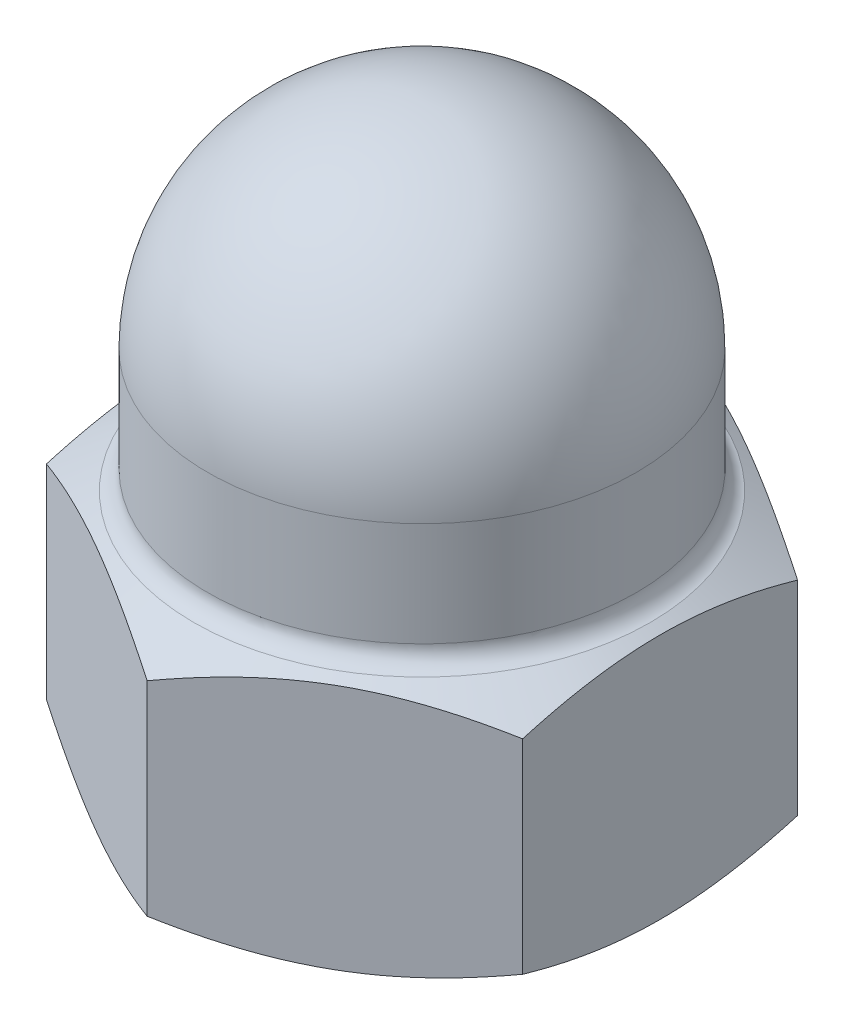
ISO-10303-21;
HEADER;
FILE_DESCRIPTION(('STEP AP214'),'2;1');
FILE_NAME('part.step','',(''),(''),'','','');
FILE_SCHEMA(('AUTOMOTIVE_DESIGN { 1 0 10303 214 1 1 1 1 }'));
ENDSEC;
DATA;
#1=APPLICATION_CONTEXT('core data for automotive mechanical design processes');
#2=APPLICATION_PROTOCOL_DEFINITION('international standard','automotive_design',2000,#1);
#3=PRODUCT_CONTEXT('',#1,'mechanical');
#4=PRODUCT('Part','Part','',(#3));
#5=PRODUCT_RELATED_PRODUCT_CATEGORY('part','',(#4));
#6=PRODUCT_DEFINITION_FORMATION('','',#4);
#7=PRODUCT_DEFINITION_CONTEXT('part definition',#1,'design');
#8=PRODUCT_DEFINITION('design','',#6,#7);
#9=PRODUCT_DEFINITION_SHAPE('','',#8);
#10=(LENGTH_UNIT() NAMED_UNIT(*) SI_UNIT(.MILLI.,.METRE.));
#11=(NAMED_UNIT(*) PLANE_ANGLE_UNIT() SI_UNIT($,.RADIAN.));
#12=(NAMED_UNIT(*) SI_UNIT($,.STERADIAN.) SOLID_ANGLE_UNIT());
#13=UNCERTAINTY_MEASURE_WITH_UNIT(LENGTH_MEASURE(1.E-05),#10,'distance_accuracy_value','');
#14=(GEOMETRIC_REPRESENTATION_CONTEXT(3) GLOBAL_UNCERTAINTY_ASSIGNED_CONTEXT((#13)) GLOBAL_UNIT_ASSIGNED_CONTEXT((#10,
#11,#12)) REPRESENTATION_CONTEXT('',''));
#15=CARTESIAN_POINT('',(0.,0.,0.));
#16=DIRECTION('',(0.,0.,1.));
#17=DIRECTION('',(1.,0.,0.));
#18=AXIS2_PLACEMENT_3D('',#15,#16,#17);
#19=CARTESIAN_POINT('',(0.,-6.5,0.));
#20=DIRECTION('',(0.,-1.,0.));
#21=DIRECTION('',(1.,0.,0.));
#22=AXIS2_PLACEMENT_3D('',#19,#20,#21);
#23=CYLINDRICAL_SURFACE('',#22,5.4);
#24=CARTESIAN_POINT('',(0.,0.476969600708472,0.));
#25=DIRECTION('',(0.,-1.,0.));
#26=DIRECTION('',(0.,0.,-1.));
#27=AXIS2_PLACEMENT_3D('',#24,#25,#26);
#28=CIRCLE('',#27,5.4);
#29=CARTESIAN_POINT('',(0.,0.476969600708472,-5.4));
#30=VERTEX_POINT('',#29);
#31=EDGE_CURVE('E11',#30,#30,#28,.F.);
#32=ORIENTED_EDGE('',*,*,#31,.T.);
#33=EDGE_LOOP('',(#32));
#34=FACE_BOUND('',#33,.T.);
#35=CARTESIAN_POINT('',(0.,3.1,0.));
#36=DIRECTION('',(0.,-1.,0.));
#37=DIRECTION('',(1.,0.,0.));
#38=AXIS2_PLACEMENT_3D('',#35,#36,#37);
#39=CIRCLE('',#38,5.4);
#40=CARTESIAN_POINT('',(5.4,3.1,0.));
#41=VERTEX_POINT('',#40);
#42=EDGE_CURVE('E215',#41,#41,#39,.T.);
#43=ORIENTED_EDGE('',*,*,#42,.T.);
#44=EDGE_LOOP('',(#43));
#45=FACE_BOUND('',#44,.T.);
#46=ADVANCED_FACE('F39',(#34,#45),#23,.T.);
#47=CARTESIAN_POINT('',(0.,3.1,0.));
#48=DIRECTION('',(0.,-1.,0.));
#49=DIRECTION('',(-1.,0.,0.));
#50=AXIS2_PLACEMENT_3D('',#47,#48,#49);
#51=SPHERICAL_SURFACE('',#50,5.4);
#52=ORIENTED_EDGE('',*,*,#42,.F.);
#53=EDGE_LOOP('',(#52));
#54=FACE_BOUND('',#53,.T.);
#55=ADVANCED_FACE('F205',(#54),#51,.T.);
#56=CARTESIAN_POINT('',(0.,-0.680235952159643,0.));
#57=DIRECTION('',(0.,-1.,0.));
#58=DIRECTION('',(0.,0.,-1.));
#59=AXIS2_PLACEMENT_3D('',#56,#57,#58);
#60=CONICAL_SURFACE('',#59,6.92820323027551,1.0471975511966);
#61=CARTESIAN_POINT('',(-6.0002,-0.680302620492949,3.46398614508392));
#62=CARTESIAN_POINT('',(-5.86831298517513,-0.636346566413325,3.54013114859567));
#63=CARTESIAN_POINT('',(-5.73593423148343,-0.5943853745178,3.61656005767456));
#64=CARTESIAN_POINT('',(-5.47010166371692,-0.51500214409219,3.77003856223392));
#65=CARTESIAN_POINT('',(-5.33664741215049,-0.477582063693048,3.8470884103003));
#66=CARTESIAN_POINT('',(-4.93414786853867,-0.372867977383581,4.07947163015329));
#67=CARTESIAN_POINT('',(-4.66351376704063,-0.313307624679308,4.23572230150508));
#68=CARTESIAN_POINT('',(-4.25851475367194,-0.243465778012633,4.46954859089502));
#69=CARTESIAN_POINT('',(-4.12535995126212,-0.223569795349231,4.54642555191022));
#70=CARTESIAN_POINT('',(-3.85844867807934,-0.190206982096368,4.70052684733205));
#71=CARTESIAN_POINT('',(-3.72469226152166,-0.176739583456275,4.77775115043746));
#72=CARTESIAN_POINT('',(-3.45694711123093,-0.156577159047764,4.93233388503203));
#73=CARTESIAN_POINT('',(-3.32295881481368,-0.149874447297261,5.00969206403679));
#74=CARTESIAN_POINT('',(-3.05486583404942,-0.143377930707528,5.16447561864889));
#75=CARTESIAN_POINT('',(-2.92076115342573,-0.143583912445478,5.24190099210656));
#76=CARTESIAN_POINT('',(-2.55335498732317,-0.153644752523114,5.4540230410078));
#77=CARTESIAN_POINT('',(-2.3201737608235,-0.170535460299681,5.58865028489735));
#78=CARTESIAN_POINT('',(-1.85536008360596,-0.224096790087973,5.85701058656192));
#79=CARTESIAN_POINT('',(-1.6237292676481,-0.260785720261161,5.9907427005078));
#80=CARTESIAN_POINT('',(-1.15798010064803,-0.352497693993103,6.25964310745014));
#81=CARTESIAN_POINT('',(-0.923920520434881,-0.407909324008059,6.39477746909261));
#82=CARTESIAN_POINT('',(-0.459291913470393,-0.533671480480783,6.66303092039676));
#83=CARTESIAN_POINT('',(-0.228716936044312,-0.603992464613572,6.7961534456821));
#84=CARTESIAN_POINT('',(0.000199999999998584,-0.680302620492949,6.92831870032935));
#85=B_SPLINE_CURVE_WITH_KNOTS('',3,(#61,#62,#63,#64,#65,#66,#67,#68,#69,#70,#71,#72,#73,#74,#75,
#76,#77,#78,#79,#80,#81,#82,#83,#84),.UNSPECIFIED.,.F.,.F.,(4,2,2,2,2,2,2,2,2,2,2,4),(0.,
0.475482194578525,0.951168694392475,1.90451835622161,2.36951738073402,2.83447530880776,
3.29890435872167,3.76331906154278,4.57182194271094,5.38107376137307,6.20827406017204,
7.03385036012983),.UNSPECIFIED.);
#86=CARTESIAN_POINT('',(-6.,-0.680235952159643,3.46410161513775));
#87=VERTEX_POINT('',#86);
#88=CARTESIAN_POINT('',(0.,-0.680235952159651,6.92820323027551));
#89=VERTEX_POINT('',#88);
#90=EDGE_CURVE('E146',#87,#89,#85,.T.);
#91=ORIENTED_EDGE('',*,*,#90,.T.);
#92=CARTESIAN_POINT('',(-0.000200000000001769,-0.680302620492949,6.92831870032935));
#93=CARTESIAN_POINT('',(0.131687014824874,-0.636346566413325,6.85217369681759));
#94=CARTESIAN_POINT('',(0.264065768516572,-0.594385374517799,6.7757447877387));
#95=CARTESIAN_POINT('',(0.529898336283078,-0.51500214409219,6.62226628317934));
#96=CARTESIAN_POINT('',(0.663352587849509,-0.477582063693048,6.54521643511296));
#97=CARTESIAN_POINT('',(1.06585213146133,-0.37286797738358,6.31283321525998));
#98=CARTESIAN_POINT('',(1.33648623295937,-0.313307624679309,6.15658254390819));
#99=CARTESIAN_POINT('',(1.74148524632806,-0.243465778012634,5.92275625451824));
#100=CARTESIAN_POINT('',(1.87464004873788,-0.223569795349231,5.84587929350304));
#101=CARTESIAN_POINT('',(2.14155132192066,-0.190206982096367,5.69177799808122));
#102=CARTESIAN_POINT('',(2.27530773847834,-0.176739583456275,5.6145536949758));
#103=CARTESIAN_POINT('',(2.54305288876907,-0.156577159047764,5.45997096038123));
#104=CARTESIAN_POINT('',(2.67704118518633,-0.149874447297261,5.38261278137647));
#105=CARTESIAN_POINT('',(2.94513416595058,-0.143377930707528,5.22782922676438));
#106=CARTESIAN_POINT('',(3.07923884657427,-0.143583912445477,5.1504038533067));
#107=CARTESIAN_POINT('',(3.44664501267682,-0.153644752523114,4.93828180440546));
#108=CARTESIAN_POINT('',(3.6798262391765,-0.170535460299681,4.80365456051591));
#109=CARTESIAN_POINT('',(4.14463991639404,-0.224096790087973,4.53529425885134));
#110=CARTESIAN_POINT('',(4.3762707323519,-0.260785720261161,4.40156214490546));
#111=CARTESIAN_POINT('',(4.84201989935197,-0.352497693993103,4.13266173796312));
#112=CARTESIAN_POINT('',(5.07607947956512,-0.407909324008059,3.99752737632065));
#113=CARTESIAN_POINT('',(5.54070808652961,-0.533671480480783,3.72927392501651));
#114=CARTESIAN_POINT('',(5.77128306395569,-0.603992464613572,3.59615139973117));
#115=CARTESIAN_POINT('',(6.0002,-0.680302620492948,3.46398614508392));
#116=B_SPLINE_CURVE_WITH_KNOTS('',3,(#92,#93,#94,#95,#96,#97,#98,#99,#100,#101,#102,#103,#104,
#105,#106,#107,#108,#109,#110,#111,#112,#113,#114,#115),.UNSPECIFIED.,.F.,.F.,(4,2,2,2,2,2,2,2,
2,2,2,4),(0.,0.475482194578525,0.951168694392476,1.90451835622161,2.36951738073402,
2.83447530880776,3.29890435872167,3.76331906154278,4.57182194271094,5.38107376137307,
6.20827406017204,7.03385036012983),.UNSPECIFIED.);
#117=CARTESIAN_POINT('',(6.,-0.680235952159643,3.46410161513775));
#118=VERTEX_POINT('',#117);
#119=EDGE_CURVE('E179',#89,#118,#116,.T.);
#120=ORIENTED_EDGE('',*,*,#119,.T.);
#121=CARTESIAN_POINT('',(6.,-3.0058307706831,-9.16730327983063));
#122=CARTESIAN_POINT('',(6.,-2.87868312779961,-8.90402448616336));
#123=CARTESIAN_POINT('',(6.,-2.75280558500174,-8.64012094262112));
#124=CARTESIAN_POINT('',(6.,-2.50431695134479,-8.11072646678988));
#125=CARTESIAN_POINT('',(6.,-2.38170643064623,-7.84523526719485));
#126=CARTESIAN_POINT('',(6.,-2.13982778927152,-7.31088350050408));
#127=CARTESIAN_POINT('',(6.,-2.02058300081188,-7.04201233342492));
#128=CARTESIAN_POINT('',(6.,-1.78724418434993,-6.50205268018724));
#129=CARTESIAN_POINT('',(6.,-1.67314988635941,-6.23096431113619));
#130=CARTESIAN_POINT('',(6.,-1.45016610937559,-5.68286714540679));
#131=CARTESIAN_POINT('',(6.,-1.34135497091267,-5.40582630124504));
#132=CARTESIAN_POINT('',(6.,-1.13230489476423,-4.84846960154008));
#133=CARTESIAN_POINT('',(6.,-1.03206691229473,-4.56815338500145));
#134=CARTESIAN_POINT('',(6.,-0.842870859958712,-4.004383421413));
#135=CARTESIAN_POINT('',(6.,-0.753888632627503,-3.72093786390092));
#136=CARTESIAN_POINT('',(6.,-0.590107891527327,-3.15001520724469));
#137=CARTESIAN_POINT('',(6.,-0.515304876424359,-2.86253941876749));
#138=CARTESIAN_POINT('',(6.,-0.383520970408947,-2.28336579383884));
#139=CARTESIAN_POINT('',(6.,-0.326545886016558,-1.9916666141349));
#140=CARTESIAN_POINT('',(6.,-0.234285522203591,-1.40473309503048));
#141=CARTESIAN_POINT('',(6.,-0.199000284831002,-1.10949874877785));
#142=CARTESIAN_POINT('',(6.,-0.164602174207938,-0.66618928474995));
#143=CARTESIAN_POINT('',(6.,-0.15622205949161,-0.518795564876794));
#144=CARTESIAN_POINT('',(6.,-0.145705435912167,-0.223779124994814));
#145=CARTESIAN_POINT('',(6.,-0.143568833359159,-0.076156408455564));
#146=CARTESIAN_POINT('',(6.,-0.145597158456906,0.219003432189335));
#147=CARTESIAN_POINT('',(6.,-0.149760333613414,0.366540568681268));
#148=CARTESIAN_POINT('',(6.,-0.164283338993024,0.661312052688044));
#149=CARTESIAN_POINT('',(6.,-0.174643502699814,0.808546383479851));
#150=CARTESIAN_POINT('',(6.,-0.207097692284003,1.16593282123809));
#151=CARTESIAN_POINT('',(6.,-0.232326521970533,1.37580569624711));
#152=CARTESIAN_POINT('',(6.,-0.293966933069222,1.79389389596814));
#153=CARTESIAN_POINT('',(6.,-0.330380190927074,2.00210896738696));
#154=CARTESIAN_POINT('',(6.,-0.454568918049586,2.62463727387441));
#155=CARTESIAN_POINT('',(6.,-0.557209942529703,3.03601858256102));
#156=CARTESIAN_POINT('',(6.,-0.734025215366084,3.65133704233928));
#157=CARTESIAN_POINT('',(6.,-0.797631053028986,3.85849333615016));
#158=CARTESIAN_POINT('',(6.,-0.931143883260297,4.27080472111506));
#159=CARTESIAN_POINT('',(6.,-1.00105144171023,4.47595963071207));
#160=CARTESIAN_POINT('',(6.,-1.14567282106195,4.88324395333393));
#161=CARTESIAN_POINT('',(6.,-1.22035724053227,5.08538391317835));
#162=CARTESIAN_POINT('',(6.,-1.37402520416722,5.4879462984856));
#163=CARTESIAN_POINT('',(6.,-1.45300725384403,5.68836929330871));
#164=CARTESIAN_POINT('',(6.,-1.53373523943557,5.88806980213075));
#165=B_SPLINE_CURVE_WITH_KNOTS('',3,(#121,#122,#123,#124,#125,#126,#127,#128,#129,#130,#131,
#132,#133,#134,#135,#136,#137,#138,#139,#140,#141,#142,#143,#144,#145,#146,#147,#148,#149,#150,
#151,#152,#153,#154,#155,#156,#157,#158,#159,#160,#161,#162,#163,#164),.UNSPECIFIED.,.F.,.F.,(4,
2,2,2,2,2,2,2,2,2,2,2,2,2,2,2,2,2,2,2,2,4),(0.,0.87713229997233,1.75441668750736,
2.6367564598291,3.51904992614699,4.41187010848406,5.30478963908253,6.19575901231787,
7.08644506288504,7.97742090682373,8.86839847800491,9.31118137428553,9.75395762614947,
10.1966107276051,10.6392876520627,11.2730787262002,11.9069648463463,13.1771839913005,
13.827237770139,14.4773499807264,15.123787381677,15.7700014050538),.UNSPECIFIED.);
#166=CARTESIAN_POINT('',(6.,-0.680235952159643,-3.46410161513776));
#167=VERTEX_POINT('',#166);
#168=EDGE_CURVE('E249',#118,#167,#165,.F.);
#169=ORIENTED_EDGE('',*,*,#168,.T.);
#170=CARTESIAN_POINT('',(6.0002,-0.680302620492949,-3.46398614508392));
#171=CARTESIAN_POINT('',(5.86831298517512,-0.636346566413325,-3.54013114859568));
#172=CARTESIAN_POINT('',(5.73593423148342,-0.5943853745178,-3.61656005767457));
#173=CARTESIAN_POINT('',(5.47010166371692,-0.51500214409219,-3.77003856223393));
#174=CARTESIAN_POINT('',(5.33664741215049,-0.477582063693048,-3.84708841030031));
#175=CARTESIAN_POINT('',(4.93414786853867,-0.372867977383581,-4.07947163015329));
#176=CARTESIAN_POINT('',(4.66351376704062,-0.31330762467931,-4.23572230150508));
#177=CARTESIAN_POINT('',(4.25851475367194,-0.243465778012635,-4.46954859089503));
#178=CARTESIAN_POINT('',(4.12535995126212,-0.223569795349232,-4.54642555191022));
#179=CARTESIAN_POINT('',(3.85844867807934,-0.190206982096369,-4.70052684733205));
#180=CARTESIAN_POINT('',(3.72469226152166,-0.176739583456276,-4.77775115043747));
#181=CARTESIAN_POINT('',(3.45694711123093,-0.156577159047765,-4.93233388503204));
#182=CARTESIAN_POINT('',(3.32295881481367,-0.149874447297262,-5.0096920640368));
#183=CARTESIAN_POINT('',(3.05486583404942,-0.14337793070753,-5.16447561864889));
#184=CARTESIAN_POINT('',(2.92076115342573,-0.143583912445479,-5.24190099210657));
#185=CARTESIAN_POINT('',(2.55335498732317,-0.153644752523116,-5.45402304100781));
#186=CARTESIAN_POINT('',(2.3201737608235,-0.170535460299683,-5.58865028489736));
#187=CARTESIAN_POINT('',(1.85536008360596,-0.224096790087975,-5.85701058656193));
#188=CARTESIAN_POINT('',(1.6237292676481,-0.260785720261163,-5.99074270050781));
#189=CARTESIAN_POINT('',(1.15798010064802,-0.352497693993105,-6.25964310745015));
#190=CARTESIAN_POINT('',(0.923920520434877,-0.407909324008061,-6.39477746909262));
#191=CARTESIAN_POINT('',(0.45929191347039,-0.533671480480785,-6.66303092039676));
#192=CARTESIAN_POINT('',(0.228716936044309,-0.603992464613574,-6.7961534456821));
#193=CARTESIAN_POINT('',(-0.000200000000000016,-0.68030262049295,-6.92831870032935));
#194=B_SPLINE_CURVE_WITH_KNOTS('',3,(#170,#171,#172,#173,#174,#175,#176,#177,#178,#179,#180,
#181,#182,#183,#184,#185,#186,#187,#188,#189,#190,#191,#192,#193),.UNSPECIFIED.,.F.,.F.,(4,2,2,
2,2,2,2,2,2,2,2,4),(0.,0.475482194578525,0.951168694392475,1.90451835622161,2.36951738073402,
2.83447530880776,3.29890435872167,3.76331906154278,4.57182194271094,5.38107376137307,
6.20827406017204,7.03385036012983),.UNSPECIFIED.);
#195=CARTESIAN_POINT('',(0.,-0.680235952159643,-6.92820323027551));
#196=VERTEX_POINT('',#195);
#197=EDGE_CURVE('E238',#167,#196,#194,.T.);
#198=ORIENTED_EDGE('',*,*,#197,.T.);
#199=CARTESIAN_POINT('',(0.00020000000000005,-0.680302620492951,-6.92831870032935));
#200=CARTESIAN_POINT('',(-0.131687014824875,-0.636346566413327,-6.85217369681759));
#201=CARTESIAN_POINT('',(-0.264065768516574,-0.594385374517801,-6.7757447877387));
#202=CARTESIAN_POINT('',(-0.52989833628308,-0.515002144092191,-6.62226628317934));
#203=CARTESIAN_POINT('',(-0.663352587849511,-0.477582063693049,-6.54521643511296));
#204=CARTESIAN_POINT('',(-1.06585213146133,-0.372867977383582,-6.31283321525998));
#205=CARTESIAN_POINT('',(-1.33648623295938,-0.313307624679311,-6.15658254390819));
#206=CARTESIAN_POINT('',(-1.74148524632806,-0.243465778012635,-5.92275625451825));
#207=CARTESIAN_POINT('',(-1.87464004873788,-0.223569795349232,-5.84587929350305));
#208=CARTESIAN_POINT('',(-2.14155132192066,-0.190206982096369,-5.69177799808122));
#209=CARTESIAN_POINT('',(-2.27530773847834,-0.176739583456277,-5.6145536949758));
#210=CARTESIAN_POINT('',(-2.54305288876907,-0.156577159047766,-5.45997096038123));
#211=CARTESIAN_POINT('',(-2.67704118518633,-0.149874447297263,-5.38261278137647));
#212=CARTESIAN_POINT('',(-2.94513416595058,-0.14337793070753,-5.22782922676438));
#213=CARTESIAN_POINT('',(-3.07923884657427,-0.143583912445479,-5.15040385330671));
#214=CARTESIAN_POINT('',(-3.44664501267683,-0.153644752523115,-4.93828180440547));
#215=CARTESIAN_POINT('',(-3.6798262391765,-0.170535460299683,-4.80365456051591));
#216=CARTESIAN_POINT('',(-4.14463991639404,-0.224096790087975,-4.53529425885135));
#217=CARTESIAN_POINT('',(-4.3762707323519,-0.260785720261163,-4.40156214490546));
#218=CARTESIAN_POINT('',(-4.84201989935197,-0.352497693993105,-4.13266173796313));
#219=CARTESIAN_POINT('',(-5.07607947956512,-0.40790932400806,-3.99752737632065));
#220=CARTESIAN_POINT('',(-5.54070808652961,-0.533671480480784,-3.72927392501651));
#221=CARTESIAN_POINT('',(-5.77128306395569,-0.603992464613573,-3.59615139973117));
#222=CARTESIAN_POINT('',(-6.0002,-0.68030262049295,-3.46398614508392));
#223=B_SPLINE_CURVE_WITH_KNOTS('',3,(#199,#200,#201,#202,#203,#204,#205,#206,#207,#208,#209,
#210,#211,#212,#213,#214,#215,#216,#217,#218,#219,#220,#221,#222),.UNSPECIFIED.,.F.,.F.,(4,2,2,
2,2,2,2,2,2,2,2,4),(0.,0.475482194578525,0.951168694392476,1.90451835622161,2.36951738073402,
2.83447530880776,3.29890435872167,3.76331906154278,4.57182194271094,5.38107376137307,
6.20827406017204,7.03385036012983),.UNSPECIFIED.);
#224=CARTESIAN_POINT('',(-6.,-0.680235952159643,-3.46410161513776));
#225=VERTEX_POINT('',#224);
#226=EDGE_CURVE('E147',#196,#225,#223,.T.);
#227=ORIENTED_EDGE('',*,*,#226,.T.);
#228=CARTESIAN_POINT('',(-6.,-3.0058307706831,-9.16730327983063));
#229=CARTESIAN_POINT('',(-6.,-2.87868312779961,-8.90402448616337));
#230=CARTESIAN_POINT('',(-6.,-2.75280558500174,-8.64012094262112));
#231=CARTESIAN_POINT('',(-6.,-2.5043169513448,-8.11072646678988));
#232=CARTESIAN_POINT('',(-6.,-2.38170643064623,-7.84523526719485));
#233=CARTESIAN_POINT('',(-6.,-2.13982778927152,-7.31088350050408));
#234=CARTESIAN_POINT('',(-6.,-2.02058300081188,-7.04201233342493));
#235=CARTESIAN_POINT('',(-6.,-1.78724418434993,-6.50205268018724));
#236=CARTESIAN_POINT('',(-6.,-1.67314988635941,-6.2309643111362));
#237=CARTESIAN_POINT('',(-6.,-1.45016610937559,-5.6828671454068));
#238=CARTESIAN_POINT('',(-6.,-1.34135497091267,-5.40582630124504));
#239=CARTESIAN_POINT('',(-6.,-1.13230489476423,-4.84846960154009));
#240=CARTESIAN_POINT('',(-6.,-1.03206691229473,-4.56815338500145));
#241=CARTESIAN_POINT('',(-6.,-0.842870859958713,-4.004383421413));
#242=CARTESIAN_POINT('',(-6.,-0.753888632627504,-3.72093786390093));
#243=CARTESIAN_POINT('',(-6.,-0.590107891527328,-3.1500152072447));
#244=CARTESIAN_POINT('',(-6.,-0.51530487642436,-2.86253941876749));
#245=CARTESIAN_POINT('',(-6.,-0.383520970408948,-2.28336579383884));
#246=CARTESIAN_POINT('',(-6.,-0.326545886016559,-1.9916666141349));
#247=CARTESIAN_POINT('',(-6.,-0.234285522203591,-1.40473309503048));
#248=CARTESIAN_POINT('',(-6.,-0.199000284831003,-1.10949874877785));
#249=CARTESIAN_POINT('',(-6.,-0.164602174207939,-0.666189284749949));
#250=CARTESIAN_POINT('',(-6.,-0.156222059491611,-0.518795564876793));
#251=CARTESIAN_POINT('',(-6.,-0.145705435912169,-0.223779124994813));
#252=CARTESIAN_POINT('',(-6.,-0.14356883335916,-0.0761564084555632));
#253=CARTESIAN_POINT('',(-6.,-0.145597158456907,0.219003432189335));
#254=CARTESIAN_POINT('',(-6.,-0.149760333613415,0.366540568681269));
#255=CARTESIAN_POINT('',(-6.,-0.164283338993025,0.661312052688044));
#256=CARTESIAN_POINT('',(-6.,-0.174643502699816,0.808546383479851));
#257=CARTESIAN_POINT('',(-6.,-0.207097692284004,1.16593282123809));
#258=CARTESIAN_POINT('',(-6.,-0.232326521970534,1.3758056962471));
#259=CARTESIAN_POINT('',(-6.,-0.293966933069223,1.79389389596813));
#260=CARTESIAN_POINT('',(-6.,-0.330380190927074,2.00210896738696));
#261=CARTESIAN_POINT('',(-6.,-0.454568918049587,2.62463727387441));
#262=CARTESIAN_POINT('',(-6.,-0.557209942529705,3.03601858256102));
#263=CARTESIAN_POINT('',(-6.,-0.734025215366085,3.65133704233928));
#264=CARTESIAN_POINT('',(-6.,-0.797631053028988,3.85849333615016));
#265=CARTESIAN_POINT('',(-6.,-0.931143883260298,4.27080472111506));
#266=CARTESIAN_POINT('',(-6.,-1.00105144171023,4.47595963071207));
#267=CARTESIAN_POINT('',(-6.,-1.14567282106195,4.88324395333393));
#268=CARTESIAN_POINT('',(-6.,-1.22035724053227,5.08538391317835));
#269=CARTESIAN_POINT('',(-6.,-1.37402520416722,5.4879462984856));
#270=CARTESIAN_POINT('',(-6.,-1.45300725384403,5.68836929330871));
#271=CARTESIAN_POINT('',(-6.,-1.53373523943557,5.88806980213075));
#272=B_SPLINE_CURVE_WITH_KNOTS('',3,(#228,#229,#230,#231,#232,#233,#234,#235,#236,#237,#238,
#239,#240,#241,#242,#243,#244,#245,#246,#247,#248,#249,#250,#251,#252,#253,#254,#255,#256,#257,
#258,#259,#260,#261,#262,#263,#264,#265,#266,#267,#268,#269,#270,#271),.UNSPECIFIED.,.F.,.F.,(4,
2,2,2,2,2,2,2,2,2,2,2,2,2,2,2,2,2,2,2,2,4),(0.,0.877132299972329,1.75441668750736,
2.6367564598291,3.51904992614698,4.41187010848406,5.30478963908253,6.19575901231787,
7.08644506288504,7.97742090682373,8.86839847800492,9.31118137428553,9.75395762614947,
10.1966107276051,10.6392876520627,11.2730787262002,11.9069648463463,13.1771839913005,
13.827237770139,14.4773499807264,15.123787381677,15.7700014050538),.UNSPECIFIED.);
#273=EDGE_CURVE('E138',#225,#87,#272,.T.);
#274=ORIENTED_EDGE('',*,*,#273,.T.);
#275=EDGE_LOOP('',(#91,#120,#169,#198,#227,#274));
#276=FACE_BOUND('',#275,.T.);
#277=CARTESIAN_POINT('',(0.,0.,0.));
#278=DIRECTION('',(0.,1.,0.));
#279=DIRECTION('',(0.,0.,1.));
#280=AXIS2_PLACEMENT_3D('',#277,#278,#279);
#281=CIRCLE('',#280,5.75);
#282=CARTESIAN_POINT('',(0.,0.,5.75));
#283=VERTEX_POINT('',#282);
#284=EDGE_CURVE('E250',#283,#283,#281,.T.);
#285=ORIENTED_EDGE('',*,*,#284,.F.);
#286=EDGE_LOOP('',(#285));
#287=FACE_BOUND('',#286,.T.);
#288=ADVANCED_FACE('F132',(#276,#287),#60,.T.);
#289=CARTESIAN_POINT('',(0.,-24.8303027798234,6.92820323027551));
#290=DIRECTION('',(0.5,0.,0.866025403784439));
#291=DIRECTION('',(0.866025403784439,0.,-0.5));
#292=AXIS2_PLACEMENT_3D('',#289,#290,#291);
#293=PLANE('',#292);
#294=CARTESIAN_POINT('',(6.0002,-5.81969737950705,3.46398614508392));
#295=CARTESIAN_POINT('',(5.86831298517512,-5.86365343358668,3.54013114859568));
#296=CARTESIAN_POINT('',(5.73593423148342,-5.9056146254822,3.61656005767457));
#297=CARTESIAN_POINT('',(5.47010166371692,-5.98499785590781,3.77003856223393));
#298=CARTESIAN_POINT('',(5.33664741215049,-6.02241793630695,3.84708841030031));
#299=CARTESIAN_POINT('',(4.93414786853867,-6.12713202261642,4.07947163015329));
#300=CARTESIAN_POINT('',(4.66351376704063,-6.18669237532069,4.23572230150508));
#301=CARTESIAN_POINT('',(4.25851475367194,-6.25653422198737,4.46954859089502));
#302=CARTESIAN_POINT('',(4.12535995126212,-6.27643020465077,4.54642555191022));
#303=CARTESIAN_POINT('',(3.85844867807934,-6.30979301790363,4.70052684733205));
#304=CARTESIAN_POINT('',(3.72469226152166,-6.32326041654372,4.77775115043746));
#305=CARTESIAN_POINT('',(3.45694711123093,-6.34342284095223,4.93233388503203));
#306=CARTESIAN_POINT('',(3.32295881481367,-6.35012555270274,5.0096920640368));
#307=CARTESIAN_POINT('',(3.05486583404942,-6.35662206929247,5.16447561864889));
#308=CARTESIAN_POINT('',(2.92076115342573,-6.35641608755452,5.24190099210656));
#309=CARTESIAN_POINT('',(2.55335498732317,-6.34635524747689,5.4540230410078));
#310=CARTESIAN_POINT('',(2.3201737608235,-6.32946453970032,5.58865028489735));
#311=CARTESIAN_POINT('',(1.85536008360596,-6.27590320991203,5.85701058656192));
#312=CARTESIAN_POINT('',(1.6237292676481,-6.23921427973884,5.9907427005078));
#313=CARTESIAN_POINT('',(1.15798010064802,-6.1475023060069,6.25964310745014));
#314=CARTESIAN_POINT('',(0.923920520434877,-6.09209067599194,6.39477746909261));
#315=CARTESIAN_POINT('',(0.459291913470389,-5.96632851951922,6.66303092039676));
#316=CARTESIAN_POINT('',(0.228716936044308,-5.89600753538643,6.7961534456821));
#317=CARTESIAN_POINT('',(-0.000200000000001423,-5.81969737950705,6.92831870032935));
#318=B_SPLINE_CURVE_WITH_KNOTS('',3,(#294,#295,#296,#297,#298,#299,#300,#301,#302,#303,#304,
#305,#306,#307,#308,#309,#310,#311,#312,#313,#314,#315,#316,#317),.UNSPECIFIED.,.F.,.F.,(4,2,2,
2,2,2,2,2,2,2,2,4),(0.,0.475482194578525,0.951168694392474,1.90451835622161,2.36951738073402,
2.83447530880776,3.29890435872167,3.76331906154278,4.57182194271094,5.38107376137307,
6.20827406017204,7.03385036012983),.UNSPECIFIED.);
#319=CARTESIAN_POINT('',(6.,-5.81976404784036,3.46410161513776));
#320=VERTEX_POINT('',#319);
#321=CARTESIAN_POINT('',(0.,-5.81976404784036,6.92820323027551));
#322=VERTEX_POINT('',#321);
#323=EDGE_CURVE('E54',#320,#322,#318,.T.);
#324=ORIENTED_EDGE('',*,*,#323,.F.);
#325=DIRECTION('',(0.,1.,0.));
#326=VECTOR('',#325,1.);
#327=CARTESIAN_POINT('',(6.,-24.8303027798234,3.46410161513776));
#328=LINE('',#327,#326);
#329=EDGE_CURVE('E220',#320,#118,#328,.T.);
#330=ORIENTED_EDGE('',*,*,#329,.T.);
#331=ORIENTED_EDGE('',*,*,#119,.F.);
#332=DIRECTION('',(0.,1.,0.));
#333=VECTOR('',#332,1.);
#334=CARTESIAN_POINT('',(0.,-24.8303027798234,6.92820323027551));
#335=LINE('',#334,#333);
#336=EDGE_CURVE('E61',#322,#89,#335,.T.);
#337=ORIENTED_EDGE('',*,*,#336,.F.);
#338=EDGE_LOOP('',(#324,#330,#331,#337));
#339=FACE_BOUND('',#338,.T.);
#340=ADVANCED_FACE('F165',(#339),#293,.T.);
#341=CARTESIAN_POINT('',(6.,-24.8303027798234,3.46410161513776));
#342=DIRECTION('',(1.,0.,0.));
#343=DIRECTION('',(0.,0.,-1.));
#344=AXIS2_PLACEMENT_3D('',#341,#342,#343);
#345=PLANE('',#344);
#346=CARTESIAN_POINT('',(6.,-3.49416922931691,-9.16730327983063));
#347=CARTESIAN_POINT('',(6.,-3.62131687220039,-8.90402448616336));
#348=CARTESIAN_POINT('',(6.,-3.74719441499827,-8.64012094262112));
#349=CARTESIAN_POINT('',(6.,-3.99568304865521,-8.11072646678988));
#350=CARTESIAN_POINT('',(6.,-4.11829356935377,-7.84523526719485));
#351=CARTESIAN_POINT('',(6.,-4.36017221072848,-7.31088350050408));
#352=CARTESIAN_POINT('',(6.,-4.47941699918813,-7.04201233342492));
#353=CARTESIAN_POINT('',(6.,-4.71275581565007,-6.50205268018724));
#354=CARTESIAN_POINT('',(6.,-4.8268501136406,-6.23096431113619));
#355=CARTESIAN_POINT('',(6.,-5.04983389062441,-5.68286714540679));
#356=CARTESIAN_POINT('',(6.,-5.15864502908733,-5.40582630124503));
#357=CARTESIAN_POINT('',(6.,-5.36769510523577,-4.84846960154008));
#358=CARTESIAN_POINT('',(6.,-5.46793308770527,-4.56815338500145));
#359=CARTESIAN_POINT('',(6.,-5.65712914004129,-4.004383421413));
#360=CARTESIAN_POINT('',(6.,-5.7461113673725,-3.72093786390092));
#361=CARTESIAN_POINT('',(6.,-5.90989210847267,-3.1500152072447));
#362=CARTESIAN_POINT('',(6.,-5.98469512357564,-2.86253941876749));
#363=CARTESIAN_POINT('',(6.,-6.11647902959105,-2.28336579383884));
#364=CARTESIAN_POINT('',(6.,-6.17345411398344,-1.9916666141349));
#365=CARTESIAN_POINT('',(6.,-6.26571447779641,-1.40473309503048));
#366=CARTESIAN_POINT('',(6.,-6.300999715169,-1.10949874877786));
#367=CARTESIAN_POINT('',(6.,-6.33539782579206,-0.666189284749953));
#368=CARTESIAN_POINT('',(6.,-6.34377794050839,-0.518795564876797));
#369=CARTESIAN_POINT('',(6.,-6.35429456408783,-0.223779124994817));
#370=CARTESIAN_POINT('',(6.,-6.35643116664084,-0.0761564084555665));
#371=CARTESIAN_POINT('',(6.,-6.35440284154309,0.219003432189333));
#372=CARTESIAN_POINT('',(6.,-6.35023966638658,0.366540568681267));
#373=CARTESIAN_POINT('',(6.,-6.33571666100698,0.661312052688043));
#374=CARTESIAN_POINT('',(6.,-6.32535649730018,0.808546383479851));
#375=CARTESIAN_POINT('',(6.,-6.292902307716,1.16593282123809));
#376=CARTESIAN_POINT('',(6.,-6.26767347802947,1.37580569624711));
#377=CARTESIAN_POINT('',(6.,-6.20603306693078,1.79389389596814));
#378=CARTESIAN_POINT('',(6.,-6.16961980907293,2.00210896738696));
#379=CARTESIAN_POINT('',(6.,-6.04543108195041,2.62463727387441));
#380=CARTESIAN_POINT('',(6.,-5.94279005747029,3.03601858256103));
#381=CARTESIAN_POINT('',(6.,-5.76597478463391,3.65133704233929));
#382=CARTESIAN_POINT('',(6.,-5.70236894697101,3.85849333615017));
#383=CARTESIAN_POINT('',(6.,-5.5688561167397,4.27080472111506));
#384=CARTESIAN_POINT('',(6.,-5.49894855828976,4.47595963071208));
#385=CARTESIAN_POINT('',(6.,-5.35432717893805,4.88324395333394));
#386=CARTESIAN_POINT('',(6.,-5.27964275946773,5.08538391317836));
#387=CARTESIAN_POINT('',(6.,-5.12597479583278,5.48794629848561));
#388=CARTESIAN_POINT('',(6.,-5.04699274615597,5.68836929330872));
#389=CARTESIAN_POINT('',(6.,-4.96626476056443,5.88806980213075));
#390=B_SPLINE_CURVE_WITH_KNOTS('',3,(#346,#347,#348,#349,#350,#351,#352,#353,#354,#355,#356,
#357,#358,#359,#360,#361,#362,#363,#364,#365,#366,#367,#368,#369,#370,#371,#372,#373,#374,#375,
#376,#377,#378,#379,#380,#381,#382,#383,#384,#385,#386,#387,#388,#389),.UNSPECIFIED.,.F.,.F.,(4,
2,2,2,2,2,2,2,2,2,2,2,2,2,2,2,2,2,2,2,2,4),(0.,0.877132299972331,1.75441668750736,
2.6367564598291,3.51904992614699,4.41187010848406,5.30478963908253,6.19575901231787,
7.08644506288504,7.97742090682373,8.86839847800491,9.31118137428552,9.75395762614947,
10.1966107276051,10.6392876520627,11.2730787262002,11.9069648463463,13.1771839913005,
13.827237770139,14.4773499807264,15.123787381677,15.7700014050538),.UNSPECIFIED.);
#391=CARTESIAN_POINT('',(6.,-5.81976404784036,-3.46410161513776));
#392=VERTEX_POINT('',#391);
#393=EDGE_CURVE('E247',#392,#320,#390,.T.);
#394=ORIENTED_EDGE('',*,*,#393,.F.);
#395=DIRECTION('',(0.,1.,0.));
#396=VECTOR('',#395,1.);
#397=CARTESIAN_POINT('',(6.,-24.8303027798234,-3.46410161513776));
#398=LINE('',#397,#396);
#399=EDGE_CURVE('E222',#392,#167,#398,.T.);
#400=ORIENTED_EDGE('',*,*,#399,.T.);
#401=ORIENTED_EDGE('',*,*,#168,.F.);
#402=ORIENTED_EDGE('',*,*,#329,.F.);
#403=EDGE_LOOP('',(#394,#400,#401,#402));
#404=FACE_BOUND('',#403,.T.);
#405=ADVANCED_FACE('F246',(#404),#345,.T.);
#406=CARTESIAN_POINT('',(6.,-24.8303027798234,-3.46410161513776));
#407=DIRECTION('',(0.5,0.,-0.866025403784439));
#408=DIRECTION('',(-0.866025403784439,0.,-0.5));
#409=AXIS2_PLACEMENT_3D('',#406,#407,#408);
#410=PLANE('',#409);
#411=CARTESIAN_POINT('',(-0.000200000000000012,-5.81969737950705,-6.92831870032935));
#412=CARTESIAN_POINT('',(0.131687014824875,-5.86365343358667,-6.85217369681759));
#413=CARTESIAN_POINT('',(0.264065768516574,-5.9056146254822,-6.7757447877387));
#414=CARTESIAN_POINT('',(0.529898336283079,-5.98499785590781,-6.62226628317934));
#415=CARTESIAN_POINT('',(0.663352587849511,-6.02241793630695,-6.54521643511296));
#416=CARTESIAN_POINT('',(1.06585213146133,-6.12713202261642,-6.31283321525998));
#417=CARTESIAN_POINT('',(1.33648623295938,-6.18669237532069,-6.15658254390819));
#418=CARTESIAN_POINT('',(1.74148524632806,-6.25653422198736,-5.92275625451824));
#419=CARTESIAN_POINT('',(1.87464004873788,-6.27643020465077,-5.84587929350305));
#420=CARTESIAN_POINT('',(2.14155132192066,-6.30979301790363,-5.69177799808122));
#421=CARTESIAN_POINT('',(2.27530773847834,-6.32326041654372,-5.6145536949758));
#422=CARTESIAN_POINT('',(2.54305288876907,-6.34342284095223,-5.45997096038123));
#423=CARTESIAN_POINT('',(2.67704118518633,-6.35012555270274,-5.38261278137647));
#424=CARTESIAN_POINT('',(2.94513416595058,-6.35662206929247,-5.22782922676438));
#425=CARTESIAN_POINT('',(3.07923884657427,-6.35641608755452,-5.15040385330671));
#426=CARTESIAN_POINT('',(3.44664501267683,-6.34635524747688,-4.93828180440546));
#427=CARTESIAN_POINT('',(3.6798262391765,-6.32946453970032,-4.80365456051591));
#428=CARTESIAN_POINT('',(4.14463991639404,-6.27590320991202,-4.53529425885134));
#429=CARTESIAN_POINT('',(4.3762707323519,-6.23921427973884,-4.40156214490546));
#430=CARTESIAN_POINT('',(4.84201989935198,-6.14750230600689,-4.13266173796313));
#431=CARTESIAN_POINT('',(5.07607947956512,-6.09209067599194,-3.99752737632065));
#432=CARTESIAN_POINT('',(5.54070808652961,-5.96632851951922,-3.72927392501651));
#433=CARTESIAN_POINT('',(5.77128306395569,-5.89600753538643,-3.59615139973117));
#434=CARTESIAN_POINT('',(6.0002,-5.81969737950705,-3.46398614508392));
#435=B_SPLINE_CURVE_WITH_KNOTS('',3,(#411,#412,#413,#414,#415,#416,#417,#418,#419,#420,#421,
#422,#423,#424,#425,#426,#427,#428,#429,#430,#431,#432,#433,#434),.UNSPECIFIED.,.F.,.F.,(4,2,2,
2,2,2,2,2,2,2,2,4),(0.,0.475482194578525,0.951168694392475,1.90451835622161,2.36951738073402,
2.83447530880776,3.29890435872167,3.76331906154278,4.57182194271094,5.38107376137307,
6.20827406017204,7.03385036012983),.UNSPECIFIED.);
#436=CARTESIAN_POINT('',(0.,-5.81976404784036,-6.92820323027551));
#437=VERTEX_POINT('',#436);
#438=EDGE_CURVE('E273',#437,#392,#435,.T.);
#439=ORIENTED_EDGE('',*,*,#438,.F.);
#440=DIRECTION('',(0.,1.,0.));
#441=VECTOR('',#440,1.);
#442=CARTESIAN_POINT('',(0.,-24.8303027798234,-6.92820323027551));
#443=LINE('',#442,#441);
#444=EDGE_CURVE('E224',#437,#196,#443,.T.);
#445=ORIENTED_EDGE('',*,*,#444,.T.);
#446=ORIENTED_EDGE('',*,*,#197,.F.);
#447=ORIENTED_EDGE('',*,*,#399,.F.);
#448=EDGE_LOOP('',(#439,#445,#446,#447));
#449=FACE_BOUND('',#448,.T.);
#450=ADVANCED_FACE('F265',(#449),#410,.T.);
#451=CARTESIAN_POINT('',(0.,-24.8303027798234,-6.92820323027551));
#452=DIRECTION('',(-0.5,0.,-0.866025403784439));
#453=DIRECTION('',(-0.866025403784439,0.,0.5));
#454=AXIS2_PLACEMENT_3D('',#451,#452,#453);
#455=PLANE('',#454);
#456=CARTESIAN_POINT('',(-6.0002,-5.81969737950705,-3.46398614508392));
#457=CARTESIAN_POINT('',(-5.86831298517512,-5.86365343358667,-3.54013114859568));
#458=CARTESIAN_POINT('',(-5.73593423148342,-5.9056146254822,-3.61656005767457));
#459=CARTESIAN_POINT('',(-5.47010166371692,-5.98499785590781,-3.77003856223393));
#460=CARTESIAN_POINT('',(-5.33664741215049,-6.02241793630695,-3.84708841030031));
#461=CARTESIAN_POINT('',(-4.93414786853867,-6.12713202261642,-4.07947163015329));
#462=CARTESIAN_POINT('',(-4.66351376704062,-6.18669237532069,-4.23572230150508));
#463=CARTESIAN_POINT('',(-4.25851475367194,-6.25653422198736,-4.46954859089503));
#464=CARTESIAN_POINT('',(-4.12535995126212,-6.27643020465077,-4.54642555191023));
#465=CARTESIAN_POINT('',(-3.85844867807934,-6.30979301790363,-4.70052684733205));
#466=CARTESIAN_POINT('',(-3.72469226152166,-6.32326041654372,-4.77775115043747));
#467=CARTESIAN_POINT('',(-3.45694711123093,-6.34342284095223,-4.93233388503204));
#468=CARTESIAN_POINT('',(-3.32295881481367,-6.35012555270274,-5.0096920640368));
#469=CARTESIAN_POINT('',(-3.05486583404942,-6.35662206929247,-5.16447561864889));
#470=CARTESIAN_POINT('',(-2.92076115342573,-6.35641608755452,-5.24190099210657));
#471=CARTESIAN_POINT('',(-2.55335498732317,-6.34635524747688,-5.45402304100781));
#472=CARTESIAN_POINT('',(-2.3201737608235,-6.32946453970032,-5.58865028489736));
#473=CARTESIAN_POINT('',(-1.85536008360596,-6.27590320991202,-5.85701058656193));
#474=CARTESIAN_POINT('',(-1.6237292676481,-6.23921427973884,-5.99074270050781));
#475=CARTESIAN_POINT('',(-1.15798010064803,-6.14750230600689,-6.25964310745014));
#476=CARTESIAN_POINT('',(-0.923920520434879,-6.09209067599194,-6.39477746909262));
#477=CARTESIAN_POINT('',(-0.459291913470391,-5.96632851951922,-6.66303092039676));
#478=CARTESIAN_POINT('',(-0.22871693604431,-5.89600753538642,-6.7961534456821));
#479=CARTESIAN_POINT('',(0.000200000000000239,-5.81969737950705,-6.92831870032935));
#480=B_SPLINE_CURVE_WITH_KNOTS('',3,(#456,#457,#458,#459,#460,#461,#462,#463,#464,#465,#466,
#467,#468,#469,#470,#471,#472,#473,#474,#475,#476,#477,#478,#479),.UNSPECIFIED.,.F.,.F.,(4,2,2,
2,2,2,2,2,2,2,2,4),(0.,0.475482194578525,0.951168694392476,1.90451835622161,2.36951738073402,
2.83447530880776,3.29890435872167,3.76331906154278,4.57182194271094,5.38107376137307,
6.20827406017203,7.03385036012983),.UNSPECIFIED.);
#481=CARTESIAN_POINT('',(-6.,-5.81976404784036,-3.46410161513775));
#482=VERTEX_POINT('',#481);
#483=EDGE_CURVE('E115',#482,#437,#480,.T.);
#484=ORIENTED_EDGE('',*,*,#483,.F.);
#485=DIRECTION('',(0.,1.,0.));
#486=VECTOR('',#485,1.);
#487=CARTESIAN_POINT('',(-6.,-24.8303027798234,-3.46410161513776));
#488=LINE('',#487,#486);
#489=EDGE_CURVE('E217',#482,#225,#488,.T.);
#490=ORIENTED_EDGE('',*,*,#489,.T.);
#491=ORIENTED_EDGE('',*,*,#226,.F.);
#492=ORIENTED_EDGE('',*,*,#444,.F.);
#493=EDGE_LOOP('',(#484,#490,#491,#492));
#494=FACE_BOUND('',#493,.T.);
#495=ADVANCED_FACE('F130',(#494),#455,.T.);
#496=CARTESIAN_POINT('',(-6.,-24.8303027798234,-3.46410161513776));
#497=DIRECTION('',(-1.,0.,0.));
#498=DIRECTION('',(0.,0.,1.));
#499=AXIS2_PLACEMENT_3D('',#496,#497,#498);
#500=PLANE('',#499);
#501=CARTESIAN_POINT('',(-6.,-3.49416922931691,-9.16730327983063));
#502=CARTESIAN_POINT('',(-6.,-3.62131687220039,-8.90402448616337));
#503=CARTESIAN_POINT('',(-6.,-3.74719441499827,-8.64012094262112));
#504=CARTESIAN_POINT('',(-6.,-3.99568304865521,-8.11072646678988));
#505=CARTESIAN_POINT('',(-6.,-4.11829356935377,-7.84523526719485));
#506=CARTESIAN_POINT('',(-6.,-4.36017221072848,-7.31088350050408));
#507=CARTESIAN_POINT('',(-6.,-4.47941699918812,-7.04201233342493));
#508=CARTESIAN_POINT('',(-6.,-4.71275581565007,-6.50205268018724));
#509=CARTESIAN_POINT('',(-6.,-4.82685011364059,-6.2309643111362));
#510=CARTESIAN_POINT('',(-6.,-5.04983389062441,-5.6828671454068));
#511=CARTESIAN_POINT('',(-6.,-5.15864502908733,-5.40582630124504));
#512=CARTESIAN_POINT('',(-6.,-5.36769510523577,-4.84846960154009));
#513=CARTESIAN_POINT('',(-6.,-5.46793308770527,-4.56815338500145));
#514=CARTESIAN_POINT('',(-6.,-5.65712914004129,-4.004383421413));
#515=CARTESIAN_POINT('',(-6.,-5.7461113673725,-3.72093786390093));
#516=CARTESIAN_POINT('',(-6.,-5.90989210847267,-3.1500152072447));
#517=CARTESIAN_POINT('',(-6.,-5.98469512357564,-2.86253941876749));
#518=CARTESIAN_POINT('',(-6.,-6.11647902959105,-2.28336579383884));
#519=CARTESIAN_POINT('',(-6.,-6.17345411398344,-1.9916666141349));
#520=CARTESIAN_POINT('',(-6.,-6.26571447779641,-1.40473309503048));
#521=CARTESIAN_POINT('',(-6.,-6.300999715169,-1.10949874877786));
#522=CARTESIAN_POINT('',(-6.,-6.33539782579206,-0.666189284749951));
#523=CARTESIAN_POINT('',(-6.,-6.34377794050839,-0.518795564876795));
#524=CARTESIAN_POINT('',(-6.,-6.35429456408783,-0.223779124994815));
#525=CARTESIAN_POINT('',(-6.,-6.35643116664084,-0.0761564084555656));
#526=CARTESIAN_POINT('',(-6.,-6.35440284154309,0.219003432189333));
#527=CARTESIAN_POINT('',(-6.,-6.35023966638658,0.366540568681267));
#528=CARTESIAN_POINT('',(-6.,-6.33571666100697,0.661312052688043));
#529=CARTESIAN_POINT('',(-6.,-6.32535649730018,0.80854638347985));
#530=CARTESIAN_POINT('',(-6.,-6.292902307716,1.16593282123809));
#531=CARTESIAN_POINT('',(-6.,-6.26767347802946,1.3758056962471));
#532=CARTESIAN_POINT('',(-6.,-6.20603306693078,1.79389389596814));
#533=CARTESIAN_POINT('',(-6.,-6.16961980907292,2.00210896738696));
#534=CARTESIAN_POINT('',(-6.,-6.04543108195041,2.62463727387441));
#535=CARTESIAN_POINT('',(-6.,-5.94279005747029,3.03601858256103));
#536=CARTESIAN_POINT('',(-6.,-5.76597478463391,3.65133704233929));
#537=CARTESIAN_POINT('',(-6.,-5.70236894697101,3.85849333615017));
#538=CARTESIAN_POINT('',(-6.,-5.5688561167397,4.27080472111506));
#539=CARTESIAN_POINT('',(-6.,-5.49894855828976,4.47595963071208));
#540=CARTESIAN_POINT('',(-6.,-5.35432717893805,4.88324395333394));
#541=CARTESIAN_POINT('',(-6.,-5.27964275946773,5.08538391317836));
#542=CARTESIAN_POINT('',(-6.,-5.12597479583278,5.48794629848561));
#543=CARTESIAN_POINT('',(-6.,-5.04699274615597,5.68836929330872));
#544=CARTESIAN_POINT('',(-6.,-4.96626476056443,5.88806980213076));
#545=B_SPLINE_CURVE_WITH_KNOTS('',3,(#501,#502,#503,#504,#505,#506,#507,#508,#509,#510,#511,
#512,#513,#514,#515,#516,#517,#518,#519,#520,#521,#522,#523,#524,#525,#526,#527,#528,#529,#530,
#531,#532,#533,#534,#535,#536,#537,#538,#539,#540,#541,#542,#543,#544),.UNSPECIFIED.,.F.,.F.,(4,
2,2,2,2,2,2,2,2,2,2,2,2,2,2,2,2,2,2,2,2,4),(0.,0.877132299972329,1.75441668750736,
2.6367564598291,3.51904992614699,4.41187010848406,5.30478963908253,6.19575901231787,
7.08644506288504,7.97742090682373,8.86839847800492,9.31118137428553,9.75395762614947,
10.1966107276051,10.6392876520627,11.2730787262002,11.9069648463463,13.1771839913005,
13.827237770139,14.4773499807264,15.123787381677,15.7700014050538),.UNSPECIFIED.);
#546=CARTESIAN_POINT('',(-6.,-5.81976404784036,3.46410161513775));
#547=VERTEX_POINT('',#546);
#548=EDGE_CURVE('E105',#547,#482,#545,.F.);
#549=ORIENTED_EDGE('',*,*,#548,.F.);
#550=DIRECTION('',(0.,1.,0.));
#551=VECTOR('',#550,1.);
#552=CARTESIAN_POINT('',(-6.,-24.8303027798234,3.46410161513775));
#553=LINE('',#552,#551);
#554=EDGE_CURVE('E159',#547,#87,#553,.T.);
#555=ORIENTED_EDGE('',*,*,#554,.T.);
#556=ORIENTED_EDGE('',*,*,#273,.F.);
#557=ORIENTED_EDGE('',*,*,#489,.F.);
#558=EDGE_LOOP('',(#549,#555,#556,#557));
#559=FACE_BOUND('',#558,.T.);
#560=ADVANCED_FACE('F126',(#559),#500,.T.);
#561=CARTESIAN_POINT('',(-6.,-24.8303027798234,3.46410161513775));
#562=DIRECTION('',(-0.5,0.,0.866025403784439));
#563=DIRECTION('',(0.866025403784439,0.,0.5));
#564=AXIS2_PLACEMENT_3D('',#561,#562,#563);
#565=PLANE('',#564);
#566=CARTESIAN_POINT('',(0.000199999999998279,-5.81969737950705,6.92831870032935));
#567=CARTESIAN_POINT('',(-0.131687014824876,-5.86365343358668,6.85217369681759));
#568=CARTESIAN_POINT('',(-0.264065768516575,-5.9056146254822,6.7757447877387));
#569=CARTESIAN_POINT('',(-0.529898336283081,-5.98499785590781,6.62226628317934));
#570=CARTESIAN_POINT('',(-0.663352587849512,-6.02241793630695,6.54521643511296));
#571=CARTESIAN_POINT('',(-1.06585213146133,-6.12713202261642,6.31283321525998));
#572=CARTESIAN_POINT('',(-1.33648623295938,-6.18669237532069,6.15658254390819));
#573=CARTESIAN_POINT('',(-1.74148524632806,-6.25653422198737,5.92275625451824));
#574=CARTESIAN_POINT('',(-1.87464004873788,-6.27643020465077,5.84587929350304));
#575=CARTESIAN_POINT('',(-2.14155132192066,-6.30979301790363,5.69177799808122));
#576=CARTESIAN_POINT('',(-2.27530773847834,-6.32326041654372,5.6145536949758));
#577=CARTESIAN_POINT('',(-2.54305288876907,-6.34342284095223,5.45997096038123));
#578=CARTESIAN_POINT('',(-2.67704118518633,-6.35012555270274,5.38261278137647));
#579=CARTESIAN_POINT('',(-2.94513416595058,-6.35662206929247,5.22782922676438));
#580=CARTESIAN_POINT('',(-3.07923884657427,-6.35641608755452,5.1504038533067));
#581=CARTESIAN_POINT('',(-3.44664501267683,-6.34635524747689,4.93828180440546));
#582=CARTESIAN_POINT('',(-3.6798262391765,-6.32946453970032,4.80365456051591));
#583=CARTESIAN_POINT('',(-4.14463991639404,-6.27590320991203,4.53529425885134));
#584=CARTESIAN_POINT('',(-4.3762707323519,-6.23921427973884,4.40156214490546));
#585=CARTESIAN_POINT('',(-4.84201989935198,-6.1475023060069,4.13266173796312));
#586=CARTESIAN_POINT('',(-5.07607947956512,-6.09209067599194,3.99752737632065));
#587=CARTESIAN_POINT('',(-5.54070808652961,-5.96632851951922,3.7292739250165));
#588=CARTESIAN_POINT('',(-5.77128306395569,-5.89600753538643,3.59615139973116));
#589=CARTESIAN_POINT('',(-6.0002,-5.81969737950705,3.46398614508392));
#590=B_SPLINE_CURVE_WITH_KNOTS('',3,(#566,#567,#568,#569,#570,#571,#572,#573,#574,#575,#576,
#577,#578,#579,#580,#581,#582,#583,#584,#585,#586,#587,#588,#589),.UNSPECIFIED.,.F.,.F.,(4,2,2,
2,2,2,2,2,2,2,2,4),(0.,0.475482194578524,0.951168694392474,1.90451835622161,2.36951738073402,
2.83447530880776,3.29890435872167,3.76331906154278,4.57182194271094,5.38107376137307,
6.20827406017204,7.03385036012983),.UNSPECIFIED.);
#591=EDGE_CURVE('E171',#322,#547,#590,.T.);
#592=ORIENTED_EDGE('',*,*,#591,.F.);
#593=ORIENTED_EDGE('',*,*,#336,.T.);
#594=ORIENTED_EDGE('',*,*,#90,.F.);
#595=ORIENTED_EDGE('',*,*,#554,.F.);
#596=EDGE_LOOP('',(#592,#593,#594,#595));
#597=FACE_BOUND('',#596,.T.);
#598=ADVANCED_FACE('F129',(#597),#565,.T.);
#599=CARTESIAN_POINT('',(0.,-6.5,0.));
#600=DIRECTION('',(0.,1.,0.));
#601=DIRECTION('',(0.,0.,1.));
#602=AXIS2_PLACEMENT_3D('',#599,#600,#601);
#603=CONICAL_SURFACE('',#602,5.75,1.0471975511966);
#604=ORIENTED_EDGE('',*,*,#323,.T.);
#605=ORIENTED_EDGE('',*,*,#591,.T.);
#606=ORIENTED_EDGE('',*,*,#548,.T.);
#607=ORIENTED_EDGE('',*,*,#483,.T.);
#608=ORIENTED_EDGE('',*,*,#438,.T.);
#609=ORIENTED_EDGE('',*,*,#393,.T.);
#610=EDGE_LOOP('',(#604,#605,#606,#607,#608,#609));
#611=FACE_BOUND('',#610,.T.);
#612=CARTESIAN_POINT('',(0.,-6.5,0.));
#613=DIRECTION('',(0.,1.,0.));
#614=DIRECTION('',(0.,0.,1.));
#615=AXIS2_PLACEMENT_3D('',#612,#613,#614);
#616=CIRCLE('',#615,5.75);
#617=CARTESIAN_POINT('',(0.,-6.5,5.75));
#618=VERTEX_POINT('',#617);
#619=EDGE_CURVE('E102',#618,#618,#616,.T.);
#620=ORIENTED_EDGE('',*,*,#619,.T.);
#621=EDGE_LOOP('',(#620));
#622=FACE_BOUND('',#621,.T.);
#623=ADVANCED_FACE('F122',(#611,#622),#603,.T.);
#624=CARTESIAN_POINT('',(-5.4,-6.5,0.));
#625=DIRECTION('',(0.,1.,0.));
#626=DIRECTION('',(-1.,0.,0.));
#627=AXIS2_PLACEMENT_3D('',#624,#625,#626);
#628=PLANE('',#627);
#629=CARTESIAN_POINT('',(0.,-6.5,0.));
#630=DIRECTION('',(0.,1.,0.));
#631=DIRECTION('',(-1.,0.,0.));
#632=AXIS2_PLACEMENT_3D('',#629,#630,#631);
#633=CIRCLE('',#632,3.98889727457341);
#634=CARTESIAN_POINT('',(3.98889727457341,-6.5,0.));
#635=VERTEX_POINT('',#634);
#636=EDGE_CURVE('E47',#635,#635,#633,.T.);
#637=ORIENTED_EDGE('',*,*,#636,.T.);
#638=EDGE_LOOP('',(#637));
#639=FACE_BOUND('',#638,.T.);
#640=ORIENTED_EDGE('',*,*,#619,.F.);
#641=EDGE_LOOP('',(#640));
#642=FACE_BOUND('',#641,.T.);
#643=ADVANCED_FACE('F189',(#639,#642),#628,.F.);
#644=CARTESIAN_POINT('',(0.,1.5,0.));
#645=DIRECTION('',(0.,-1.,0.));
#646=DIRECTION('',(1.,0.,0.));
#647=AXIS2_PLACEMENT_3D('',#644,#645,#646);
#648=CYLINDRICAL_SURFACE('',#647,3.4);
#649=CARTESIAN_POINT('',(0.,-6.16,0.));
#650=DIRECTION('',(0.,1.,0.));
#651=DIRECTION('',(-1.,0.,0.));
#652=AXIS2_PLACEMENT_3D('',#649,#650,#651);
#653=CIRCLE('',#652,3.4);
#654=CARTESIAN_POINT('',(3.4,-6.16,0.));
#655=VERTEX_POINT('',#654);
#656=EDGE_CURVE('E178',#655,#655,#653,.F.);
#657=ORIENTED_EDGE('',*,*,#656,.T.);
#658=EDGE_LOOP('',(#657));
#659=FACE_BOUND('',#658,.T.);
#660=CARTESIAN_POINT('',(0.,6.03700908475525,0.));
#661=DIRECTION('',(0.,-1.,0.));
#662=DIRECTION('',(0.,0.,-1.));
#663=AXIS2_PLACEMENT_3D('',#660,#661,#662);
#664=CIRCLE('',#663,3.4);
#665=CARTESIAN_POINT('',(0.,6.03700908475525,-3.4));
#666=VERTEX_POINT('',#665);
#667=EDGE_CURVE('E100',#666,#666,#664,.T.);
#668=ORIENTED_EDGE('',*,*,#667,.F.);
#669=EDGE_LOOP('',(#668));
#670=FACE_BOUND('',#669,.T.);
#671=ADVANCED_FACE('F195',(#659,#670),#648,.F.);
#672=CARTESIAN_POINT('',(0.,-6.16,0.));
#673=DIRECTION('',(0.,-1.,0.));
#674=DIRECTION('',(1.,0.,0.));
#675=AXIS2_PLACEMENT_3D('',#672,#673,#674);
#676=CONICAL_SURFACE('',#675,3.4,1.04719755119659);
#677=CARTESIAN_POINT('',(3.98889727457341,-6.5,0.));
#678=CARTESIAN_POINT('',(3.98276292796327,-6.49645833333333,0.));
#679=CARTESIAN_POINT('',(3.97662858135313,-6.49291666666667,0.));
#680=CARTESIAN_POINT('',(3.96435988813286,-6.48583333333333,0.));
#681=CARTESIAN_POINT('',(3.95822554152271,-6.48229166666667,0.));
#682=CARTESIAN_POINT('',(3.94595684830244,-6.47520833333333,0.));
#683=CARTESIAN_POINT('',(3.9398225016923,-6.47166666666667,0.));
#684=CARTESIAN_POINT('',(3.92755380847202,-6.46458333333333,0.));
#685=CARTESIAN_POINT('',(3.92141946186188,-6.46104166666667,0.));
#686=CARTESIAN_POINT('',(3.9091507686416,-6.45395833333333,0.));
#687=CARTESIAN_POINT('',(3.90301642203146,-6.45041666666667,0.));
#688=CARTESIAN_POINT('',(3.89074772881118,-6.44333333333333,0.));
#689=CARTESIAN_POINT('',(3.88461338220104,-6.43979166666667,0.));
#690=CARTESIAN_POINT('',(3.87234468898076,-6.43270833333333,0.));
#691=CARTESIAN_POINT('',(3.86621034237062,-6.42916666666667,0.));
#692=CARTESIAN_POINT('',(3.85394164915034,-6.42208333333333,0.));
#693=CARTESIAN_POINT('',(3.8478073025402,-6.41854166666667,0.));
#694=CARTESIAN_POINT('',(3.83553860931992,-6.41145833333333,0.));
#695=CARTESIAN_POINT('',(3.82940426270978,-6.40791666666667,0.));
#696=CARTESIAN_POINT('',(3.8171355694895,-6.40083333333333,0.));
#697=CARTESIAN_POINT('',(3.81100122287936,-6.39729166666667,0.));
#698=CARTESIAN_POINT('',(3.79873252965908,-6.39020833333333,0.));
#699=CARTESIAN_POINT('',(3.79259818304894,-6.38666666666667,0.));
#700=CARTESIAN_POINT('',(3.78032948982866,-6.37958333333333,0.));
#701=CARTESIAN_POINT('',(3.77419514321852,-6.37604166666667,0.));
#702=CARTESIAN_POINT('',(3.76192644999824,-6.36895833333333,0.));
#703=CARTESIAN_POINT('',(3.7557921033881,-6.36541666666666,0.));
#704=CARTESIAN_POINT('',(3.74352341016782,-6.35833333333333,0.));
#705=CARTESIAN_POINT('',(3.73738906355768,-6.35479166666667,0.));
#706=CARTESIAN_POINT('',(3.72512037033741,-6.34770833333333,0.));
#707=CARTESIAN_POINT('',(3.71898602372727,-6.34416666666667,0.));
#708=CARTESIAN_POINT('',(3.70671733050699,-6.33708333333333,0.));
#709=CARTESIAN_POINT('',(3.70058298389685,-6.33354166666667,0.));
#710=CARTESIAN_POINT('',(3.68831429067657,-6.32645833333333,0.));
#711=CARTESIAN_POINT('',(3.68217994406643,-6.32291666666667,0.));
#712=CARTESIAN_POINT('',(3.66991125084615,-6.31583333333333,0.));
#713=CARTESIAN_POINT('',(3.66377690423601,-6.31229166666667,0.));
#714=CARTESIAN_POINT('',(3.65150821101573,-6.30520833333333,0.));
#715=CARTESIAN_POINT('',(3.64537386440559,-6.30166666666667,0.));
#716=CARTESIAN_POINT('',(3.63310517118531,-6.29458333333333,0.));
#717=CARTESIAN_POINT('',(3.62697082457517,-6.29104166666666,0.));
#718=CARTESIAN_POINT('',(3.61470213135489,-6.28395833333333,0.));
#719=CARTESIAN_POINT('',(3.60856778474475,-6.28041666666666,0.));
#720=CARTESIAN_POINT('',(3.59629909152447,-6.27333333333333,0.));
#721=CARTESIAN_POINT('',(3.59016474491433,-6.26979166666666,0.));
#722=CARTESIAN_POINT('',(3.57789605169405,-6.26270833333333,0.));
#723=CARTESIAN_POINT('',(3.57176170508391,-6.25916666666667,0.));
#724=CARTESIAN_POINT('',(3.55949301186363,-6.25208333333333,0.));
#725=CARTESIAN_POINT('',(3.55335866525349,-6.24854166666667,0.));
#726=CARTESIAN_POINT('',(3.54108997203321,-6.24145833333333,0.));
#727=CARTESIAN_POINT('',(3.53495562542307,-6.23791666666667,0.));
#728=CARTESIAN_POINT('',(3.52268693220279,-6.23083333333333,0.));
#729=CARTESIAN_POINT('',(3.51655258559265,-6.22729166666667,0.));
#730=CARTESIAN_POINT('',(3.50428389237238,-6.22020833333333,0.));
#731=CARTESIAN_POINT('',(3.49814954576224,-6.21666666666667,0.));
#732=CARTESIAN_POINT('',(3.48588085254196,-6.20958333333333,0.));
#733=CARTESIAN_POINT('',(3.47974650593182,-6.20604166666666,0.));
#734=CARTESIAN_POINT('',(3.46747781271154,-6.19895833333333,0.));
#735=CARTESIAN_POINT('',(3.4613434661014,-6.19541666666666,0.));
#736=CARTESIAN_POINT('',(3.44907477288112,-6.18833333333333,0.));
#737=CARTESIAN_POINT('',(3.44294042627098,-6.18479166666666,0.));
#738=CARTESIAN_POINT('',(3.4306717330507,-6.17770833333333,0.));
#739=CARTESIAN_POINT('',(3.42453738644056,-6.17416666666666,0.));
#740=CARTESIAN_POINT('',(3.41226869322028,-6.16708333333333,0.));
#741=CARTESIAN_POINT('',(3.40613434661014,-6.16354166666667,0.));
#742=CARTESIAN_POINT('',(3.4,-6.16,0.));
#743=B_SPLINE_CURVE_WITH_KNOTS('',3,(#677,#678,#679,#680,#681,#682,#683,#684,#685,#686,#687,
#688,#689,#690,#691,#692,#693,#694,#695,#696,#697,#698,#699,#700,#701,#702,#703,#704,#705,#706,
#707,#708,#709,#710,#711,#712,#713,#714,#715,#716,#717,#718,#719,#720,#721,#722,#723,#724,#725,
#726,#727,#728,#729,#730,#731,#732,#733,#734,#735,#736,#737,#738,#739,#740,#741,#742),
.UNSPECIFIED.,.F.,.F.,(4,2,2,2,2,2,2,2,2,2,2,2,2,2,2,2,2,2,2,2,2,2,2,2,2,2,2,2,2,2,2,2,4),(0.,
0.0212499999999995,0.0424999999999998,0.0637500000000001,0.0849999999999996,0.106249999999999,
0.127499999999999,0.148749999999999,0.169999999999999,0.191249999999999,0.212499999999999,
0.233749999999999,0.254999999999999,0.276249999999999,0.297499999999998,0.318749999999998,
0.339999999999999,0.361249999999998,0.382499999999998,0.403749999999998,0.424999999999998,
0.446249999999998,0.467499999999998,0.488749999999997,0.509999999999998,0.531249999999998,
0.552499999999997,0.573749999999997,0.594999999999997,0.616249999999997,0.637499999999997,
0.658749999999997,0.679999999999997),.UNSPECIFIED.);
#744=EDGE_CURVE('BSEAM192',#635,#655,#743,.T.);
#745=ORIENTED_EDGE('',*,*,#636,.F.);
#746=ORIENTED_EDGE('',*,*,#656,.F.);
#747=ORIENTED_EDGE('',*,*,#744,.T.);
#748=ORIENTED_EDGE('',*,*,#744,.F.);
#749=EDGE_LOOP('',(#745,#747,#746,#748));
#750=FACE_BOUND('',#749,.T.);
#751=ADVANCED_FACE('F192',(#750),#676,.F.);
#752=CARTESIAN_POINT('',(0.,0.476969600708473,0.));
#753=DIRECTION('',(0.,-1.,0.));
#754=DIRECTION('',(0.,0.,-1.));
#755=AXIS2_PLACEMENT_3D('',#752,#753,#754);
#756=TOROIDAL_SURFACE('',#755,5.9,0.5);
#757=ORIENTED_EDGE('',*,*,#31,.F.);
#758=EDGE_LOOP('',(#757));
#759=FACE_BOUND('',#758,.T.);
#760=ORIENTED_EDGE('',*,*,#284,.T.);
#761=EDGE_LOOP('',(#760));
#762=FACE_BOUND('',#761,.T.);
#763=ADVANCED_FACE('F41',(#759,#762),#756,.F.);
#764=CARTESIAN_POINT('',(0.,6.03700908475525,0.));
#765=DIRECTION('',(0.,-1.,0.));
#766=DIRECTION('',(0.,0.,-1.));
#767=AXIS2_PLACEMENT_3D('',#764,#765,#766);
#768=CONICAL_SURFACE('',#767,3.4,1.04719755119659);
#769=CARTESIAN_POINT('',(0.,8.,0.));
#770=VERTEX_POINT('',#769);
#771=VERTEX_LOOP('',#770);
#772=FACE_BOUND('',#771,.T.);
#773=ORIENTED_EDGE('',*,*,#667,.T.);
#774=EDGE_LOOP('',(#773));
#775=FACE_BOUND('',#774,.T.);
#776=ADVANCED_FACE('F94',(#772,#775),#768,.F.);
#777=CLOSED_SHELL('',(#46,#55,#288,#340,#405,#450,#495,#560,#598,#623,#643,#671,#751,#763,#776));
#778=MANIFOLD_SOLID_BREP('B2',#777);
#779=ADVANCED_BREP_SHAPE_REPRESENTATION('',(#18,#778),#14);
#780=SHAPE_DEFINITION_REPRESENTATION(#9,#779);
ENDSEC;
END-ISO-10303-21;
